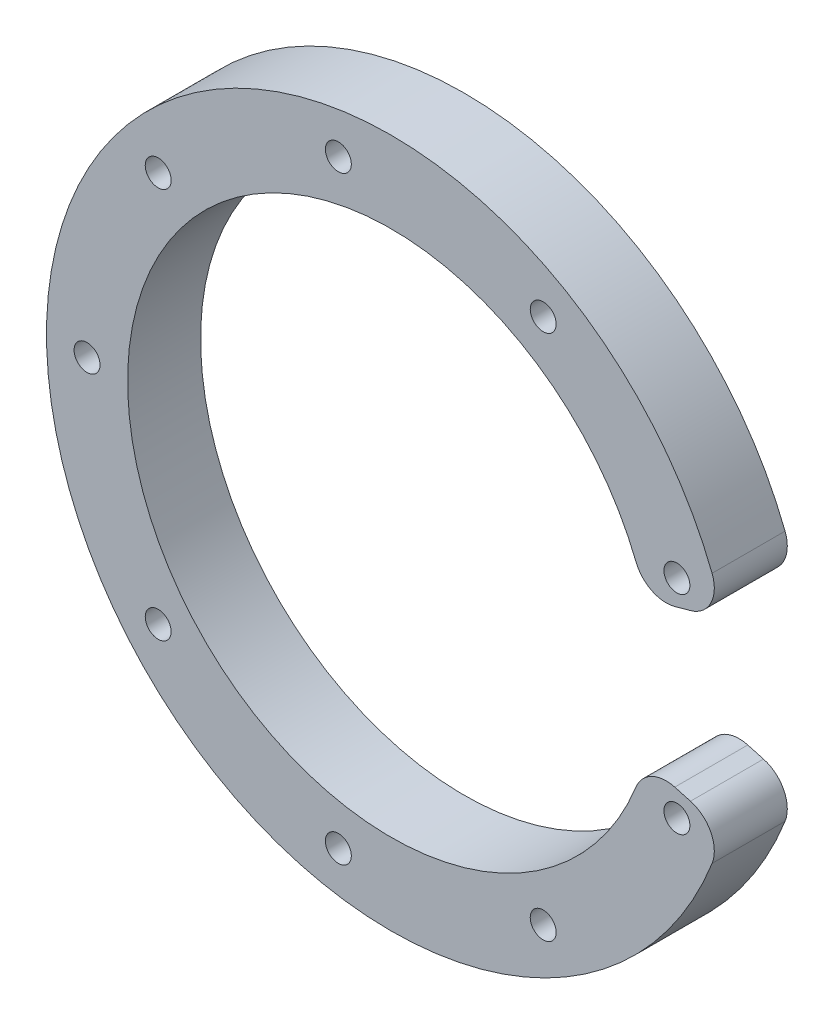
ISO-10303-21;
HEADER;
FILE_DESCRIPTION(('STEP AP214'),'2;1');
FILE_NAME('part.step','',(''),(''),'','','');
FILE_SCHEMA(('AUTOMOTIVE_DESIGN { 1 0 10303 214 1 1 1 1 }'));
ENDSEC;
DATA;
#1=APPLICATION_CONTEXT('core data for automotive mechanical design processes');
#2=APPLICATION_PROTOCOL_DEFINITION('international standard','automotive_design',2000,#1);
#3=PRODUCT_CONTEXT('',#1,'mechanical');
#4=PRODUCT('Part','Part','',(#3));
#5=PRODUCT_RELATED_PRODUCT_CATEGORY('part','',(#4));
#6=PRODUCT_DEFINITION_FORMATION('','',#4);
#7=PRODUCT_DEFINITION_CONTEXT('part definition',#1,'design');
#8=PRODUCT_DEFINITION('design','',#6,#7);
#9=PRODUCT_DEFINITION_SHAPE('','',#8);
#10=(LENGTH_UNIT() NAMED_UNIT(*) SI_UNIT(.MILLI.,.METRE.));
#11=(NAMED_UNIT(*) PLANE_ANGLE_UNIT() SI_UNIT($,.RADIAN.));
#12=(NAMED_UNIT(*) SI_UNIT($,.STERADIAN.) SOLID_ANGLE_UNIT());
#13=UNCERTAINTY_MEASURE_WITH_UNIT(LENGTH_MEASURE(1.E-05),#10,'distance_accuracy_value','');
#14=(GEOMETRIC_REPRESENTATION_CONTEXT(3) GLOBAL_UNCERTAINTY_ASSIGNED_CONTEXT((#13)) GLOBAL_UNIT_ASSIGNED_CONTEXT((#10,
#11,#12)) REPRESENTATION_CONTEXT('',''));
#15=CARTESIAN_POINT('',(0.,0.,0.));
#16=DIRECTION('',(0.,0.,1.));
#17=DIRECTION('',(1.,0.,0.));
#18=AXIS2_PLACEMENT_3D('',#15,#16,#17);
#19=CARTESIAN_POINT('',(46.,37.9919333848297,9.));
#20=DIRECTION('',(0.,0.,-1.));
#21=DIRECTION('',(-1.,0.,0.));
#22=AXIS2_PLACEMENT_3D('',#19,#20,#21);
#23=PLANE('',#22);
#24=CARTESIAN_POINT('',(-6.51180666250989,36.9302907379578,9.));
#25=DIRECTION('',(0.,0.,-1.));
#26=DIRECTION('',(-1.,0.,0.));
#27=AXIS2_PLACEMENT_3D('',#24,#25,#26);
#28=CIRCLE('',#27,1.6);
#29=CARTESIAN_POINT('',(-8.11180666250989,36.9302907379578,9.));
#30=VERTEX_POINT('',#29);
#31=EDGE_CURVE('E42',#30,#30,#28,.T.);
#32=ORIENTED_EDGE('',*,*,#31,.T.);
#33=EDGE_LOOP('',(#32));
#34=FACE_BOUND('',#33,.T.);
#35=CARTESIAN_POINT('',(-28.7266666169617,24.1045353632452,9.));
#36=DIRECTION('',(0.,0.,-1.));
#37=DIRECTION('',(-1.,0.,0.));
#38=AXIS2_PLACEMENT_3D('',#35,#36,#37);
#39=CIRCLE('',#38,1.6);
#40=CARTESIAN_POINT('',(-30.3266666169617,24.1045353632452,9.));
#41=VERTEX_POINT('',#40);
#42=EDGE_CURVE('E188',#41,#41,#39,.T.);
#43=ORIENTED_EDGE('',*,*,#42,.T.);
#44=EDGE_LOOP('',(#43));
#45=FACE_BOUND('',#44,.T.);
#46=CARTESIAN_POINT('',(-37.5,0.,9.));
#47=DIRECTION('',(0.,0.,-1.));
#48=DIRECTION('',(-1.,0.,0.));
#49=AXIS2_PLACEMENT_3D('',#46,#47,#48);
#50=CIRCLE('',#49,1.6);
#51=CARTESIAN_POINT('',(-39.1,0.,9.));
#52=VERTEX_POINT('',#51);
#53=EDGE_CURVE('E186',#52,#52,#50,.T.);
#54=ORIENTED_EDGE('',*,*,#53,.T.);
#55=EDGE_LOOP('',(#54));
#56=FACE_BOUND('',#55,.T.);
#57=CARTESIAN_POINT('',(-6.51180666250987,-36.9302907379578,9.));
#58=DIRECTION('',(0.,0.,-1.));
#59=DIRECTION('',(-1.,0.,0.));
#60=AXIS2_PLACEMENT_3D('',#57,#58,#59);
#61=CIRCLE('',#60,1.6);
#62=CARTESIAN_POINT('',(-8.11180666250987,-36.9302907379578,9.));
#63=VERTEX_POINT('',#62);
#64=EDGE_CURVE('E183',#63,#63,#61,.T.);
#65=ORIENTED_EDGE('',*,*,#64,.T.);
#66=EDGE_LOOP('',(#65));
#67=FACE_BOUND('',#66,.T.);
#68=CARTESIAN_POINT('',(-28.7266666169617,-24.1045353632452,9.));
#69=DIRECTION('',(0.,0.,-1.));
#70=DIRECTION('',(-1.,0.,0.));
#71=AXIS2_PLACEMENT_3D('',#68,#69,#70);
#72=CIRCLE('',#71,1.6);
#73=CARTESIAN_POINT('',(-30.3266666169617,-24.1045353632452,9.));
#74=VERTEX_POINT('',#73);
#75=EDGE_CURVE('E180',#74,#74,#72,.T.);
#76=ORIENTED_EDGE('',*,*,#75,.T.);
#77=EDGE_LOOP('',(#76));
#78=FACE_BOUND('',#77,.T.);
#79=CARTESIAN_POINT('',(18.75,32.4759526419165,9.));
#80=DIRECTION('',(0.,0.,-1.));
#81=DIRECTION('',(-1.,0.,0.));
#82=AXIS2_PLACEMENT_3D('',#79,#80,#81);
#83=CIRCLE('',#82,1.59999999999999);
#84=CARTESIAN_POINT('',(17.15,32.4759526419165,9.));
#85=VERTEX_POINT('',#84);
#86=EDGE_CURVE('E177',#85,#85,#83,.T.);
#87=ORIENTED_EDGE('',*,*,#86,.T.);
#88=EDGE_LOOP('',(#87));
#89=FACE_BOUND('',#88,.T.);
#90=CARTESIAN_POINT('',(18.75,-32.4759526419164,9.));
#91=DIRECTION('',(0.,0.,-1.));
#92=DIRECTION('',(-1.,0.,0.));
#93=AXIS2_PLACEMENT_3D('',#90,#91,#92);
#94=CIRCLE('',#93,1.6);
#95=CARTESIAN_POINT('',(17.15,-32.4759526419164,9.));
#96=VERTEX_POINT('',#95);
#97=EDGE_CURVE('E174',#96,#96,#94,.T.);
#98=ORIENTED_EDGE('',*,*,#97,.T.);
#99=EDGE_LOOP('',(#98));
#100=FACE_BOUND('',#99,.T.);
#101=CARTESIAN_POINT('',(35.2384732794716,-12.8257553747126,9.));
#102=DIRECTION('',(0.,0.,-1.));
#103=DIRECTION('',(-1.,0.,0.));
#104=AXIS2_PLACEMENT_3D('',#101,#102,#103);
#105=CIRCLE('',#104,1.6);
#106=CARTESIAN_POINT('',(33.6384732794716,-12.8257553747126,9.));
#107=VERTEX_POINT('',#106);
#108=EDGE_CURVE('E171',#107,#107,#105,.T.);
#109=ORIENTED_EDGE('',*,*,#108,.T.);
#110=EDGE_LOOP('',(#109));
#111=FACE_BOUND('',#110,.T.);
#112=CARTESIAN_POINT('',(35.2384732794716,12.8257553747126,9.));
#113=DIRECTION('',(0.,0.,-1.));
#114=DIRECTION('',(-1.,0.,0.));
#115=AXIS2_PLACEMENT_3D('',#112,#113,#114);
#116=CIRCLE('',#115,1.6);
#117=CARTESIAN_POINT('',(33.6384732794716,12.8257553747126,9.));
#118=VERTEX_POINT('',#117);
#119=EDGE_CURVE('E168',#118,#118,#116,.T.);
#120=ORIENTED_EDGE('',*,*,#119,.T.);
#121=EDGE_LOOP('',(#120));
#122=FACE_BOUND('',#121,.T.);
#123=CARTESIAN_POINT('',(35.8508725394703,-14.0344197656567,9.));
#124=DIRECTION('',(0.,0.,1.));
#125=DIRECTION('',(1.,0.,0.));
#126=AXIS2_PLACEMENT_3D('',#123,#124,#125);
#127=CIRCLE('',#126,4.);
#128=CARTESIAN_POINT('',(39.5756385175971,-15.4925412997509,9.));
#129=VERTEX_POINT('',#128);
#130=CARTESIAN_POINT('',(36.9141142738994,-10.1783184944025,9.));
#131=VERTEX_POINT('',#130);
#132=EDGE_CURVE('E160',#129,#131,#127,.T.);
#133=ORIENTED_EDGE('',*,*,#132,.T.);
#134=DIRECTION('',(-0.964025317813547,0.26581043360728,0.));
#135=VECTOR('',#134,1.);
#136=CARTESIAN_POINT('',(36.150949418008,-9.96789126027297,9.));
#137=LINE('',#136,#135);
#138=CARTESIAN_POINT('',(34.9749926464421,-9.64364502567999,9.));
#139=VERTEX_POINT('',#138);
#140=EDGE_CURVE('E159',#131,#139,#137,.T.);
#141=ORIENTED_EDGE('',*,*,#140,.T.);
#142=CARTESIAN_POINT('',(33.911750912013,-13.4997462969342,9.));
#143=DIRECTION('',(0.,0.,1.));
#144=DIRECTION('',(1.,0.,0.));
#145=AXIS2_PLACEMENT_3D('',#142,#143,#144);
#146=CIRCLE('',#145,4.);
#147=CARTESIAN_POINT('',(30.1953946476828,-12.0203220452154,9.));
#148=VERTEX_POINT('',#147);
#149=EDGE_CURVE('E162',#139,#148,#146,.T.);
#150=ORIENTED_EDGE('',*,*,#149,.T.);
#151=CARTESIAN_POINT('',(0.,0.,9.));
#152=DIRECTION('',(0.,0.,-1.));
#153=DIRECTION('',(1.,0.,0.));
#154=AXIS2_PLACEMENT_3D('',#151,#152,#153);
#155=CIRCLE('',#154,32.5);
#156=CARTESIAN_POINT('',(30.1953946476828,12.0203220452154,9.));
#157=VERTEX_POINT('',#156);
#158=EDGE_CURVE('E11',#148,#157,#155,.T.);
#159=ORIENTED_EDGE('',*,*,#158,.T.);
#160=CARTESIAN_POINT('',(33.911750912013,13.4997462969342,9.));
#161=DIRECTION('',(0.,0.,1.));
#162=DIRECTION('',(1.,0.,0.));
#163=AXIS2_PLACEMENT_3D('',#160,#161,#162);
#164=CIRCLE('',#163,4.);
#165=CARTESIAN_POINT('',(34.9749926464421,9.64364502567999,9.));
#166=VERTEX_POINT('',#165);
#167=EDGE_CURVE('E165',#157,#166,#164,.T.);
#168=ORIENTED_EDGE('',*,*,#167,.T.);
#169=DIRECTION('',(0.964025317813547,0.26581043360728,0.));
#170=VECTOR('',#169,1.);
#171=CARTESIAN_POINT('',(31.3308228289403,8.63883909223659,9.));
#172=LINE('',#171,#170);
#173=CARTESIAN_POINT('',(36.9141142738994,10.1783184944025,9.));
#174=VERTEX_POINT('',#173);
#175=EDGE_CURVE('E47',#166,#174,#172,.T.);
#176=ORIENTED_EDGE('',*,*,#175,.T.);
#177=CARTESIAN_POINT('',(35.8508725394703,14.0344197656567,9.));
#178=DIRECTION('',(0.,0.,1.));
#179=DIRECTION('',(1.,0.,0.));
#180=AXIS2_PLACEMENT_3D('',#177,#178,#179);
#181=CIRCLE('',#180,4.);
#182=CARTESIAN_POINT('',(39.5756385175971,15.4925412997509,9.));
#183=VERTEX_POINT('',#182);
#184=EDGE_CURVE('E157',#174,#183,#181,.T.);
#185=ORIENTED_EDGE('',*,*,#184,.T.);
#186=CARTESIAN_POINT('',(0.,0.,9.));
#187=DIRECTION('',(0.,0.,1.));
#188=DIRECTION('',(1.,0.,0.));
#189=AXIS2_PLACEMENT_3D('',#186,#187,#188);
#190=CIRCLE('',#189,42.5);
#191=EDGE_CURVE('E55',#129,#183,#190,.F.);
#192=ORIENTED_EDGE('',*,*,#191,.F.);
#193=EDGE_LOOP('',(#133,#141,#150,#159,#168,#176,#185,#192));
#194=FACE_BOUND('',#193,.T.);
#195=ADVANCED_FACE('F39',(#34,#45,#56,#67,#78,#89,#100,#111,#122,#194),#23,.F.);
#196=CARTESIAN_POINT('',(-6.51180666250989,36.9302907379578,9.));
#197=DIRECTION('',(0.,0.,-1.));
#198=DIRECTION('',(-1.,0.,0.));
#199=AXIS2_PLACEMENT_3D('',#196,#197,#198);
#200=CYLINDRICAL_SURFACE('',#199,1.6);
#201=ORIENTED_EDGE('',*,*,#31,.F.);
#202=EDGE_LOOP('',(#201));
#203=FACE_BOUND('',#202,.T.);
#204=CARTESIAN_POINT('',(-6.51180666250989,36.9302907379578,0.));
#205=DIRECTION('',(0.,0.,1.));
#206=DIRECTION('',(1.,0.,0.));
#207=AXIS2_PLACEMENT_3D('',#204,#205,#206);
#208=CIRCLE('',#207,1.6);
#209=CARTESIAN_POINT('',(-4.9118066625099,36.9302907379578,0.));
#210=VERTEX_POINT('',#209);
#211=EDGE_CURVE('E203',#210,#210,#208,.T.);
#212=ORIENTED_EDGE('',*,*,#211,.F.);
#213=EDGE_LOOP('',(#212));
#214=FACE_BOUND('',#213,.T.);
#215=ADVANCED_FACE('F196',(#203,#214),#200,.F.);
#216=CARTESIAN_POINT('',(-28.7266666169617,24.1045353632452,9.));
#217=DIRECTION('',(0.,0.,-1.));
#218=DIRECTION('',(-1.,0.,0.));
#219=AXIS2_PLACEMENT_3D('',#216,#217,#218);
#220=CYLINDRICAL_SURFACE('',#219,1.6);
#221=ORIENTED_EDGE('',*,*,#42,.F.);
#222=EDGE_LOOP('',(#221));
#223=FACE_BOUND('',#222,.T.);
#224=CARTESIAN_POINT('',(-28.7266666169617,24.1045353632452,0.));
#225=DIRECTION('',(0.,0.,1.));
#226=DIRECTION('',(1.,0.,0.));
#227=AXIS2_PLACEMENT_3D('',#224,#225,#226);
#228=CIRCLE('',#227,1.6);
#229=CARTESIAN_POINT('',(-27.1266666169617,24.1045353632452,0.));
#230=VERTEX_POINT('',#229);
#231=EDGE_CURVE('E205',#230,#230,#228,.T.);
#232=ORIENTED_EDGE('',*,*,#231,.F.);
#233=EDGE_LOOP('',(#232));
#234=FACE_BOUND('',#233,.T.);
#235=ADVANCED_FACE('F199',(#223,#234),#220,.F.);
#236=CARTESIAN_POINT('',(-37.5,0.,9.));
#237=DIRECTION('',(0.,0.,-1.));
#238=DIRECTION('',(-1.,0.,0.));
#239=AXIS2_PLACEMENT_3D('',#236,#237,#238);
#240=CYLINDRICAL_SURFACE('',#239,1.6);
#241=ORIENTED_EDGE('',*,*,#53,.F.);
#242=EDGE_LOOP('',(#241));
#243=FACE_BOUND('',#242,.T.);
#244=CARTESIAN_POINT('',(-37.5,0.,0.));
#245=DIRECTION('',(0.,0.,1.));
#246=DIRECTION('',(1.,0.,0.));
#247=AXIS2_PLACEMENT_3D('',#244,#245,#246);
#248=CIRCLE('',#247,1.6);
#249=CARTESIAN_POINT('',(-35.9,0.,0.));
#250=VERTEX_POINT('',#249);
#251=EDGE_CURVE('E209',#250,#250,#248,.T.);
#252=ORIENTED_EDGE('',*,*,#251,.F.);
#253=EDGE_LOOP('',(#252));
#254=FACE_BOUND('',#253,.T.);
#255=ADVANCED_FACE('F270',(#243,#254),#240,.F.);
#256=CARTESIAN_POINT('',(-6.51180666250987,-36.9302907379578,9.));
#257=DIRECTION('',(0.,0.,-1.));
#258=DIRECTION('',(-1.,0.,0.));
#259=AXIS2_PLACEMENT_3D('',#256,#257,#258);
#260=CYLINDRICAL_SURFACE('',#259,1.6);
#261=ORIENTED_EDGE('',*,*,#64,.F.);
#262=EDGE_LOOP('',(#261));
#263=FACE_BOUND('',#262,.T.);
#264=CARTESIAN_POINT('',(-6.51180666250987,-36.9302907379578,0.));
#265=DIRECTION('',(0.,0.,1.));
#266=DIRECTION('',(1.,0.,0.));
#267=AXIS2_PLACEMENT_3D('',#264,#265,#266);
#268=CIRCLE('',#267,1.6);
#269=CARTESIAN_POINT('',(-4.91180666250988,-36.9302907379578,0.));
#270=VERTEX_POINT('',#269);
#271=EDGE_CURVE('E319',#270,#270,#268,.T.);
#272=ORIENTED_EDGE('',*,*,#271,.F.);
#273=EDGE_LOOP('',(#272));
#274=FACE_BOUND('',#273,.T.);
#275=ADVANCED_FACE('F297',(#263,#274),#260,.F.);
#276=CARTESIAN_POINT('',(-28.7266666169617,-24.1045353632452,9.));
#277=DIRECTION('',(0.,0.,-1.));
#278=DIRECTION('',(-1.,0.,0.));
#279=AXIS2_PLACEMENT_3D('',#276,#277,#278);
#280=CYLINDRICAL_SURFACE('',#279,1.6);
#281=ORIENTED_EDGE('',*,*,#75,.F.);
#282=EDGE_LOOP('',(#281));
#283=FACE_BOUND('',#282,.T.);
#284=CARTESIAN_POINT('',(-28.7266666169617,-24.1045353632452,0.));
#285=DIRECTION('',(0.,0.,1.));
#286=DIRECTION('',(1.,0.,0.));
#287=AXIS2_PLACEMENT_3D('',#284,#285,#286);
#288=CIRCLE('',#287,1.6);
#289=CARTESIAN_POINT('',(-27.1266666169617,-24.1045353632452,0.));
#290=VERTEX_POINT('',#289);
#291=EDGE_CURVE('E322',#290,#290,#288,.T.);
#292=ORIENTED_EDGE('',*,*,#291,.F.);
#293=EDGE_LOOP('',(#292));
#294=FACE_BOUND('',#293,.T.);
#295=ADVANCED_FACE('F290',(#283,#294),#280,.F.);
#296=CARTESIAN_POINT('',(18.75,32.4759526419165,9.));
#297=DIRECTION('',(0.,0.,-1.));
#298=DIRECTION('',(-1.,0.,0.));
#299=AXIS2_PLACEMENT_3D('',#296,#297,#298);
#300=CYLINDRICAL_SURFACE('',#299,1.59999999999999);
#301=ORIENTED_EDGE('',*,*,#86,.F.);
#302=EDGE_LOOP('',(#301));
#303=FACE_BOUND('',#302,.T.);
#304=CARTESIAN_POINT('',(18.75,32.4759526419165,0.));
#305=DIRECTION('',(0.,0.,1.));
#306=DIRECTION('',(1.,0.,0.));
#307=AXIS2_PLACEMENT_3D('',#304,#305,#306);
#308=CIRCLE('',#307,1.59999999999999);
#309=CARTESIAN_POINT('',(20.35,32.4759526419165,0.));
#310=VERTEX_POINT('',#309);
#311=EDGE_CURVE('E206',#310,#310,#308,.T.);
#312=ORIENTED_EDGE('',*,*,#311,.F.);
#313=EDGE_LOOP('',(#312));
#314=FACE_BOUND('',#313,.T.);
#315=ADVANCED_FACE('F266',(#303,#314),#300,.F.);
#316=CARTESIAN_POINT('',(18.75,-32.4759526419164,9.));
#317=DIRECTION('',(0.,0.,-1.));
#318=DIRECTION('',(-1.,0.,0.));
#319=AXIS2_PLACEMENT_3D('',#316,#317,#318);
#320=CYLINDRICAL_SURFACE('',#319,1.6);
#321=ORIENTED_EDGE('',*,*,#97,.F.);
#322=EDGE_LOOP('',(#321));
#323=FACE_BOUND('',#322,.T.);
#324=CARTESIAN_POINT('',(18.75,-32.4759526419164,0.));
#325=DIRECTION('',(0.,0.,1.));
#326=DIRECTION('',(1.,0.,0.));
#327=AXIS2_PLACEMENT_3D('',#324,#325,#326);
#328=CIRCLE('',#327,1.6);
#329=CARTESIAN_POINT('',(20.35,-32.4759526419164,0.));
#330=VERTEX_POINT('',#329);
#331=EDGE_CURVE('E315',#330,#330,#328,.T.);
#332=ORIENTED_EDGE('',*,*,#331,.F.);
#333=EDGE_LOOP('',(#332));
#334=FACE_BOUND('',#333,.T.);
#335=ADVANCED_FACE('F245',(#323,#334),#320,.F.);
#336=CARTESIAN_POINT('',(0.,0.,0.));
#337=DIRECTION('',(0.,0.,1.));
#338=DIRECTION('',(1.,0.,0.));
#339=AXIS2_PLACEMENT_3D('',#336,#337,#338);
#340=PLANE('',#339);
#341=CARTESIAN_POINT('',(0.,0.,0.));
#342=DIRECTION('',(0.,0.,1.));
#343=DIRECTION('',(1.,0.,0.));
#344=AXIS2_PLACEMENT_3D('',#341,#342,#343);
#345=CIRCLE('',#344,42.5);
#346=CARTESIAN_POINT('',(39.5756385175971,15.4925412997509,0.));
#347=VERTEX_POINT('',#346);
#348=CARTESIAN_POINT('',(39.5756385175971,-15.4925412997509,0.));
#349=VERTEX_POINT('',#348);
#350=EDGE_CURVE('E119',#347,#349,#345,.T.);
#351=ORIENTED_EDGE('',*,*,#350,.F.);
#352=CARTESIAN_POINT('',(35.8508725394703,14.0344197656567,0.));
#353=DIRECTION('',(0.,0.,1.));
#354=DIRECTION('',(1.,0.,0.));
#355=AXIS2_PLACEMENT_3D('',#352,#353,#354);
#356=CIRCLE('',#355,4.);
#357=CARTESIAN_POINT('',(36.9141142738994,10.1783184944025,0.));
#358=VERTEX_POINT('',#357);
#359=EDGE_CURVE('E105',#347,#358,#356,.F.);
#360=ORIENTED_EDGE('',*,*,#359,.T.);
#361=DIRECTION('',(0.964025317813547,0.265810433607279,0.));
#362=VECTOR('',#361,1.);
#363=CARTESIAN_POINT('',(36.150949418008,9.96789126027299,0.));
#364=LINE('',#363,#362);
#365=CARTESIAN_POINT('',(34.9749926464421,9.64364502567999,0.));
#366=VERTEX_POINT('',#365);
#367=EDGE_CURVE('E128',#366,#358,#364,.T.);
#368=ORIENTED_EDGE('',*,*,#367,.F.);
#369=CARTESIAN_POINT('',(33.911750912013,13.4997462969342,0.));
#370=DIRECTION('',(0.,0.,1.));
#371=DIRECTION('',(1.,0.,0.));
#372=AXIS2_PLACEMENT_3D('',#369,#370,#371);
#373=CIRCLE('',#372,4.);
#374=CARTESIAN_POINT('',(30.1953946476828,12.0203220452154,0.));
#375=VERTEX_POINT('',#374);
#376=EDGE_CURVE('E121',#366,#375,#373,.F.);
#377=ORIENTED_EDGE('',*,*,#376,.T.);
#378=CARTESIAN_POINT('',(0.,0.,0.));
#379=DIRECTION('',(0.,0.,-1.));
#380=DIRECTION('',(1.,0.,0.));
#381=AXIS2_PLACEMENT_3D('',#378,#379,#380);
#382=CIRCLE('',#381,32.5);
#383=CARTESIAN_POINT('',(30.1953946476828,-12.0203220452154,0.));
#384=VERTEX_POINT('',#383);
#385=EDGE_CURVE('E132',#384,#375,#382,.T.);
#386=ORIENTED_EDGE('',*,*,#385,.F.);
#387=CARTESIAN_POINT('',(33.911750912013,-13.4997462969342,0.));
#388=DIRECTION('',(0.,0.,1.));
#389=DIRECTION('',(1.,0.,0.));
#390=AXIS2_PLACEMENT_3D('',#387,#388,#389);
#391=CIRCLE('',#390,4.);
#392=CARTESIAN_POINT('',(34.9749926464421,-9.64364502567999,0.));
#393=VERTEX_POINT('',#392);
#394=EDGE_CURVE('E139',#384,#393,#391,.F.);
#395=ORIENTED_EDGE('',*,*,#394,.T.);
#396=DIRECTION('',(-0.964025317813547,0.26581043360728,0.));
#397=VECTOR('',#396,1.);
#398=CARTESIAN_POINT('',(31.3308228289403,-8.63883909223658,0.));
#399=LINE('',#398,#397);
#400=CARTESIAN_POINT('',(36.9141142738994,-10.1783184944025,0.));
#401=VERTEX_POINT('',#400);
#402=EDGE_CURVE('E127',#401,#393,#399,.T.);
#403=ORIENTED_EDGE('',*,*,#402,.F.);
#404=CARTESIAN_POINT('',(35.8508725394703,-14.0344197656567,0.));
#405=DIRECTION('',(0.,0.,1.));
#406=DIRECTION('',(1.,0.,0.));
#407=AXIS2_PLACEMENT_3D('',#404,#405,#406);
#408=CIRCLE('',#407,4.);
#409=EDGE_CURVE('E115',#401,#349,#408,.F.);
#410=ORIENTED_EDGE('',*,*,#409,.T.);
#411=EDGE_LOOP('',(#351,#360,#368,#377,#386,#395,#403,#410));
#412=FACE_BOUND('',#411,.T.);
#413=ORIENTED_EDGE('',*,*,#251,.T.);
#414=EDGE_LOOP('',(#413));
#415=FACE_BOUND('',#414,.T.);
#416=ORIENTED_EDGE('',*,*,#231,.T.);
#417=EDGE_LOOP('',(#416));
#418=FACE_BOUND('',#417,.T.);
#419=ORIENTED_EDGE('',*,*,#211,.T.);
#420=EDGE_LOOP('',(#419));
#421=FACE_BOUND('',#420,.T.);
#422=ORIENTED_EDGE('',*,*,#311,.T.);
#423=EDGE_LOOP('',(#422));
#424=FACE_BOUND('',#423,.T.);
#425=CARTESIAN_POINT('',(35.2384732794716,12.8257553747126,0.));
#426=DIRECTION('',(0.,0.,1.));
#427=DIRECTION('',(1.,0.,0.));
#428=AXIS2_PLACEMENT_3D('',#425,#426,#427);
#429=CIRCLE('',#428,1.6);
#430=CARTESIAN_POINT('',(36.8384732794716,12.8257553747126,0.));
#431=VERTEX_POINT('',#430);
#432=EDGE_CURVE('E212',#431,#431,#429,.T.);
#433=ORIENTED_EDGE('',*,*,#432,.T.);
#434=EDGE_LOOP('',(#433));
#435=FACE_BOUND('',#434,.T.);
#436=CARTESIAN_POINT('',(35.2384732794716,-12.8257553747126,0.));
#437=DIRECTION('',(0.,0.,1.));
#438=DIRECTION('',(1.,0.,0.));
#439=AXIS2_PLACEMENT_3D('',#436,#437,#438);
#440=CIRCLE('',#439,1.6);
#441=CARTESIAN_POINT('',(36.8384732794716,-12.8257553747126,0.));
#442=VERTEX_POINT('',#441);
#443=EDGE_CURVE('E311',#442,#442,#440,.T.);
#444=ORIENTED_EDGE('',*,*,#443,.T.);
#445=EDGE_LOOP('',(#444));
#446=FACE_BOUND('',#445,.T.);
#447=ORIENTED_EDGE('',*,*,#331,.T.);
#448=EDGE_LOOP('',(#447));
#449=FACE_BOUND('',#448,.T.);
#450=ORIENTED_EDGE('',*,*,#271,.T.);
#451=EDGE_LOOP('',(#450));
#452=FACE_BOUND('',#451,.T.);
#453=ORIENTED_EDGE('',*,*,#291,.T.);
#454=EDGE_LOOP('',(#453));
#455=FACE_BOUND('',#454,.T.);
#456=ADVANCED_FACE('F124',(#412,#415,#418,#421,#424,#435,#446,#449,#452,#455),#340,.F.);
#457=CARTESIAN_POINT('',(35.2384732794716,-12.8257553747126,9.));
#458=DIRECTION('',(0.,0.,-1.));
#459=DIRECTION('',(-1.,0.,0.));
#460=AXIS2_PLACEMENT_3D('',#457,#458,#459);
#461=CYLINDRICAL_SURFACE('',#460,1.6);
#462=ORIENTED_EDGE('',*,*,#108,.F.);
#463=EDGE_LOOP('',(#462));
#464=FACE_BOUND('',#463,.T.);
#465=ORIENTED_EDGE('',*,*,#443,.F.);
#466=EDGE_LOOP('',(#465));
#467=FACE_BOUND('',#466,.T.);
#468=ADVANCED_FACE('F254',(#464,#467),#461,.F.);
#469=CARTESIAN_POINT('',(35.2384732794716,12.8257553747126,9.));
#470=DIRECTION('',(0.,0.,-1.));
#471=DIRECTION('',(-1.,0.,0.));
#472=AXIS2_PLACEMENT_3D('',#469,#470,#471);
#473=CYLINDRICAL_SURFACE('',#472,1.6);
#474=ORIENTED_EDGE('',*,*,#119,.F.);
#475=EDGE_LOOP('',(#474));
#476=FACE_BOUND('',#475,.T.);
#477=ORIENTED_EDGE('',*,*,#432,.F.);
#478=EDGE_LOOP('',(#477));
#479=FACE_BOUND('',#478,.T.);
#480=ADVANCED_FACE('F262',(#476,#479),#473,.F.);
#481=CARTESIAN_POINT('',(35.8508725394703,14.0344197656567,9.));
#482=DIRECTION('',(0.,0.,-1.));
#483=DIRECTION('',(-1.,0.,0.));
#484=AXIS2_PLACEMENT_3D('',#481,#482,#483);
#485=CYLINDRICAL_SURFACE('',#484,4.);
#486=ORIENTED_EDGE('',*,*,#184,.F.);
#487=DIRECTION('',(0.,0.,-1.));
#488=VECTOR('',#487,1.);
#489=CARTESIAN_POINT('',(36.9141142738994,10.1783184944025,9.));
#490=LINE('',#489,#488);
#491=EDGE_CURVE('E109',#358,#174,#490,.F.);
#492=ORIENTED_EDGE('',*,*,#491,.F.);
#493=ORIENTED_EDGE('',*,*,#359,.F.);
#494=DIRECTION('',(0.,0.,-1.));
#495=VECTOR('',#494,1.);
#496=CARTESIAN_POINT('',(39.5756385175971,15.4925412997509,9.));
#497=LINE('',#496,#495);
#498=EDGE_CURVE('E107',#183,#347,#497,.T.);
#499=ORIENTED_EDGE('',*,*,#498,.F.);
#500=EDGE_LOOP('',(#486,#492,#493,#499));
#501=FACE_BOUND('',#500,.T.);
#502=ADVANCED_FACE('F106',(#501),#485,.T.);
#503=CARTESIAN_POINT('',(36.150949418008,9.96789126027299,9.));
#504=DIRECTION('',(-0.265810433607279,0.964025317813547,0.));
#505=DIRECTION('',(-0.964025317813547,-0.265810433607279,0.));
#506=AXIS2_PLACEMENT_3D('',#503,#504,#505);
#507=PLANE('',#506);
#508=ORIENTED_EDGE('',*,*,#367,.T.);
#509=ORIENTED_EDGE('',*,*,#491,.T.);
#510=ORIENTED_EDGE('',*,*,#175,.F.);
#511=DIRECTION('',(0.,0.,-1.));
#512=VECTOR('',#511,1.);
#513=CARTESIAN_POINT('',(34.9749926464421,9.64364502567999,9.));
#514=LINE('',#513,#512);
#515=EDGE_CURVE('E114',#166,#366,#514,.T.);
#516=ORIENTED_EDGE('',*,*,#515,.T.);
#517=EDGE_LOOP('',(#508,#509,#510,#516));
#518=FACE_BOUND('',#517,.T.);
#519=ADVANCED_FACE('F273',(#518),#507,.F.);
#520=CARTESIAN_POINT('',(33.911750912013,13.4997462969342,9.));
#521=DIRECTION('',(0.,0.,-1.));
#522=DIRECTION('',(-1.,0.,0.));
#523=AXIS2_PLACEMENT_3D('',#520,#521,#522);
#524=CYLINDRICAL_SURFACE('',#523,4.);
#525=ORIENTED_EDGE('',*,*,#167,.F.);
#526=DIRECTION('',(0.,0.,-1.));
#527=VECTOR('',#526,1.);
#528=CARTESIAN_POINT('',(30.1953946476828,12.0203220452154,9.));
#529=LINE('',#528,#527);
#530=EDGE_CURVE('E151',#375,#157,#529,.F.);
#531=ORIENTED_EDGE('',*,*,#530,.F.);
#532=ORIENTED_EDGE('',*,*,#376,.F.);
#533=ORIENTED_EDGE('',*,*,#515,.F.);
#534=EDGE_LOOP('',(#525,#531,#532,#533));
#535=FACE_BOUND('',#534,.T.);
#536=ADVANCED_FACE('F228',(#535),#524,.T.);
#537=CARTESIAN_POINT('',(0.,0.,9.));
#538=DIRECTION('',(0.,0.,-1.));
#539=DIRECTION('',(-1.,0.,0.));
#540=AXIS2_PLACEMENT_3D('',#537,#538,#539);
#541=CYLINDRICAL_SURFACE('',#540,32.5);
#542=ORIENTED_EDGE('',*,*,#158,.F.);
#543=DIRECTION('',(0.,0.,-1.));
#544=VECTOR('',#543,1.);
#545=CARTESIAN_POINT('',(30.1953946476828,-12.0203220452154,9.));
#546=LINE('',#545,#544);
#547=EDGE_CURVE('E154',#148,#384,#546,.T.);
#548=ORIENTED_EDGE('',*,*,#547,.T.);
#549=ORIENTED_EDGE('',*,*,#385,.T.);
#550=ORIENTED_EDGE('',*,*,#530,.T.);
#551=EDGE_LOOP('',(#542,#548,#549,#550));
#552=FACE_BOUND('',#551,.T.);
#553=ADVANCED_FACE('F225',(#552),#541,.F.);
#554=CARTESIAN_POINT('',(33.911750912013,-13.4997462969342,9.));
#555=DIRECTION('',(0.,0.,-1.));
#556=DIRECTION('',(-1.,0.,0.));
#557=AXIS2_PLACEMENT_3D('',#554,#555,#556);
#558=CYLINDRICAL_SURFACE('',#557,4.);
#559=ORIENTED_EDGE('',*,*,#149,.F.);
#560=DIRECTION('',(0.,0.,-1.));
#561=VECTOR('',#560,1.);
#562=CARTESIAN_POINT('',(34.9749926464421,-9.64364502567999,9.));
#563=LINE('',#562,#561);
#564=EDGE_CURVE('E145',#393,#139,#563,.F.);
#565=ORIENTED_EDGE('',*,*,#564,.F.);
#566=ORIENTED_EDGE('',*,*,#394,.F.);
#567=ORIENTED_EDGE('',*,*,#547,.F.);
#568=EDGE_LOOP('',(#559,#565,#566,#567));
#569=FACE_BOUND('',#568,.T.);
#570=ADVANCED_FACE('F232',(#569),#558,.T.);
#571=CARTESIAN_POINT('',(31.3308228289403,-8.63883909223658,9.));
#572=DIRECTION('',(-0.26581043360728,-0.964025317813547,0.));
#573=DIRECTION('',(0.964025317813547,-0.26581043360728,0.));
#574=AXIS2_PLACEMENT_3D('',#571,#572,#573);
#575=PLANE('',#574);
#576=ORIENTED_EDGE('',*,*,#140,.F.);
#577=DIRECTION('',(0.,0.,-1.));
#578=VECTOR('',#577,1.);
#579=CARTESIAN_POINT('',(36.9141142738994,-10.1783184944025,9.));
#580=LINE('',#579,#578);
#581=EDGE_CURVE('E148',#131,#401,#580,.T.);
#582=ORIENTED_EDGE('',*,*,#581,.T.);
#583=ORIENTED_EDGE('',*,*,#402,.T.);
#584=ORIENTED_EDGE('',*,*,#564,.T.);
#585=EDGE_LOOP('',(#576,#582,#583,#584));
#586=FACE_BOUND('',#585,.T.);
#587=ADVANCED_FACE('F234',(#586),#575,.F.);
#588=CARTESIAN_POINT('',(35.8508725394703,-14.0344197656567,9.));
#589=DIRECTION('',(0.,0.,-1.));
#590=DIRECTION('',(-1.,0.,0.));
#591=AXIS2_PLACEMENT_3D('',#588,#589,#590);
#592=CYLINDRICAL_SURFACE('',#591,4.);
#593=ORIENTED_EDGE('',*,*,#132,.F.);
#594=DIRECTION('',(0.,0.,-1.));
#595=VECTOR('',#594,1.);
#596=CARTESIAN_POINT('',(39.5756385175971,-15.4925412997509,9.));
#597=LINE('',#596,#595);
#598=EDGE_CURVE('E122',#349,#129,#597,.F.);
#599=ORIENTED_EDGE('',*,*,#598,.F.);
#600=ORIENTED_EDGE('',*,*,#409,.F.);
#601=ORIENTED_EDGE('',*,*,#581,.F.);
#602=EDGE_LOOP('',(#593,#599,#600,#601));
#603=FACE_BOUND('',#602,.T.);
#604=ADVANCED_FACE('F237',(#603),#592,.T.);
#605=CARTESIAN_POINT('',(0.,0.,9.));
#606=DIRECTION('',(0.,0.,-1.));
#607=DIRECTION('',(-1.,0.,0.));
#608=AXIS2_PLACEMENT_3D('',#605,#606,#607);
#609=CYLINDRICAL_SURFACE('',#608,42.5);
#610=ORIENTED_EDGE('',*,*,#191,.T.);
#611=ORIENTED_EDGE('',*,*,#498,.T.);
#612=ORIENTED_EDGE('',*,*,#350,.T.);
#613=ORIENTED_EDGE('',*,*,#598,.T.);
#614=EDGE_LOOP('',(#610,#611,#612,#613));
#615=FACE_BOUND('',#614,.T.);
#616=ADVANCED_FACE('F118',(#615),#609,.T.);
#617=CLOSED_SHELL('',(#195,#215,#235,#255,#275,#295,#315,#335,#456,#468,#480,#502,#519,#536,
#553,#570,#587,#604,#616));
#618=MANIFOLD_SOLID_BREP('B2',#617);
#619=ADVANCED_BREP_SHAPE_REPRESENTATION('',(#18,#618),#14);
#620=SHAPE_DEFINITION_REPRESENTATION(#9,#619);
ENDSEC;
END-ISO-10303-21;
